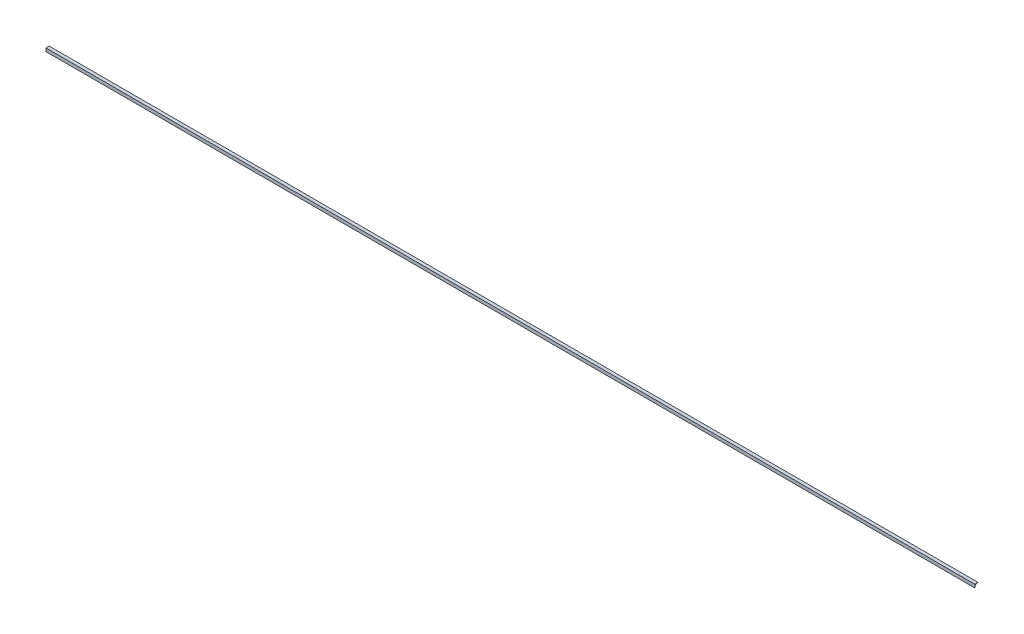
ISO-10303-21;
HEADER;
FILE_DESCRIPTION(('STEP AP214'),'2;1');
FILE_NAME('part.step','',(''),(''),'','','');
FILE_SCHEMA(('AUTOMOTIVE_DESIGN { 1 0 10303 214 1 1 1 1 }'));
ENDSEC;
DATA;
#1=APPLICATION_CONTEXT('core data for automotive mechanical design processes');
#2=APPLICATION_PROTOCOL_DEFINITION('international standard','automotive_design',2000,#1);
#3=PRODUCT_CONTEXT('',#1,'mechanical');
#4=PRODUCT('Part','Part','',(#3));
#5=PRODUCT_RELATED_PRODUCT_CATEGORY('part','',(#4));
#6=PRODUCT_DEFINITION_FORMATION('','',#4);
#7=PRODUCT_DEFINITION_CONTEXT('part definition',#1,'design');
#8=PRODUCT_DEFINITION('design','',#6,#7);
#9=PRODUCT_DEFINITION_SHAPE('','',#8);
#10=(LENGTH_UNIT() NAMED_UNIT(*) SI_UNIT(.MILLI.,.METRE.));
#11=(NAMED_UNIT(*) PLANE_ANGLE_UNIT() SI_UNIT($,.RADIAN.));
#12=(NAMED_UNIT(*) SI_UNIT($,.STERADIAN.) SOLID_ANGLE_UNIT());
#13=UNCERTAINTY_MEASURE_WITH_UNIT(LENGTH_MEASURE(1.E-05),#10,'distance_accuracy_value','');
#14=(GEOMETRIC_REPRESENTATION_CONTEXT(3) GLOBAL_UNCERTAINTY_ASSIGNED_CONTEXT((#13)) GLOBAL_UNIT_ASSIGNED_CONTEXT((#10,
#11,#12)) REPRESENTATION_CONTEXT('',''));
#15=CARTESIAN_POINT('',(0.,0.,0.));
#16=DIRECTION('',(0.,0.,1.));
#17=DIRECTION('',(1.,0.,0.));
#18=AXIS2_PLACEMENT_3D('',#15,#16,#17);
#19=CARTESIAN_POINT('',(457.2,76.2,74.6125));
#20=DIRECTION('',(0.,-1.,0.));
#21=DIRECTION('',(0.,0.,-1.));
#22=AXIS2_PLACEMENT_3D('',#19,#20,#21);
#23=PLANE('',#22);
#24=DIRECTION('',(0.,0.,1.));
#25=VECTOR('',#24,1.);
#26=CARTESIAN_POINT('',(0.,76.2,74.6125));
#27=LINE('',#26,#25);
#28=CARTESIAN_POINT('',(0.,76.2,74.6125));
#29=VERTEX_POINT('',#28);
#30=CARTESIAN_POINT('',(0.,76.2,76.2));
#31=VERTEX_POINT('',#30);
#32=EDGE_CURVE('E160',#29,#31,#27,.T.);
#33=ORIENTED_EDGE('',*,*,#32,.T.);
#34=DIRECTION('',(-1.,0.,0.));
#35=VECTOR('',#34,1.);
#36=CARTESIAN_POINT('',(457.2,76.2,76.2));
#37=LINE('',#36,#35);
#38=CARTESIAN_POINT('',(457.2,76.2,76.2));
#39=VERTEX_POINT('',#38);
#40=EDGE_CURVE('E11',#39,#31,#37,.T.);
#41=ORIENTED_EDGE('',*,*,#40,.F.);
#42=DIRECTION('',(0.,0.,1.));
#43=VECTOR('',#42,1.);
#44=CARTESIAN_POINT('',(457.2,76.2,74.6125));
#45=LINE('',#44,#43);
#46=CARTESIAN_POINT('',(457.2,76.2,74.6125));
#47=VERTEX_POINT('',#46);
#48=EDGE_CURVE('E184',#47,#39,#45,.T.);
#49=ORIENTED_EDGE('',*,*,#48,.F.);
#50=DIRECTION('',(-1.,0.,0.));
#51=VECTOR('',#50,1.);
#52=CARTESIAN_POINT('',(457.2,76.2,74.6125));
#53=LINE('',#52,#51);
#54=EDGE_CURVE('E151',#47,#29,#53,.T.);
#55=ORIENTED_EDGE('',*,*,#54,.T.);
#56=EDGE_LOOP('',(#33,#41,#49,#55));
#57=FACE_BOUND('',#56,.T.);
#58=ADVANCED_FACE('F43',(#57),#23,.F.);
#59=CARTESIAN_POINT('',(457.2,76.2,76.2));
#60=DIRECTION('',(0.,0.,-1.));
#61=DIRECTION('',(-1.,0.,0.));
#62=AXIS2_PLACEMENT_3D('',#59,#60,#61);
#63=PLANE('',#62);
#64=DIRECTION('',(0.,-1.,0.));
#65=VECTOR('',#64,1.);
#66=CARTESIAN_POINT('',(0.,76.2,76.2));
#67=LINE('',#66,#65);
#68=CARTESIAN_POINT('',(0.,74.6125,76.2));
#69=VERTEX_POINT('',#68);
#70=EDGE_CURVE('E162',#31,#69,#67,.T.);
#71=ORIENTED_EDGE('',*,*,#70,.T.);
#72=DIRECTION('',(-1.,0.,0.));
#73=VECTOR('',#72,1.);
#74=CARTESIAN_POINT('',(457.2,74.6125,76.2));
#75=LINE('',#74,#73);
#76=CARTESIAN_POINT('',(457.2,74.6125,76.2));
#77=VERTEX_POINT('',#76);
#78=EDGE_CURVE('E55',#77,#69,#75,.T.);
#79=ORIENTED_EDGE('',*,*,#78,.F.);
#80=DIRECTION('',(0.,-1.,0.));
#81=VECTOR('',#80,1.);
#82=CARTESIAN_POINT('',(457.2,76.2,76.2));
#83=LINE('',#82,#81);
#84=EDGE_CURVE('E107',#39,#77,#83,.T.);
#85=ORIENTED_EDGE('',*,*,#84,.F.);
#86=ORIENTED_EDGE('',*,*,#40,.T.);
#87=EDGE_LOOP('',(#71,#79,#85,#86));
#88=FACE_BOUND('',#87,.T.);
#89=ADVANCED_FACE('F283',(#88),#63,.F.);
#90=CARTESIAN_POINT('',(457.2,74.6125,76.2));
#91=DIRECTION('',(0.,0.0980171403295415,0.995184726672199));
#92=DIRECTION('',(0.,-0.995184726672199,0.0980171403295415));
#93=AXIS2_PLACEMENT_3D('',#90,#91,#92);
#94=PLANE('',#93);
#95=DIRECTION('',(0.,0.995184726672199,-0.0980171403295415));
#96=VECTOR('',#95,1.);
#97=CARTESIAN_POINT('',(0.,74.6125,76.2));
#98=LINE('',#97,#96);
#99=CARTESIAN_POINT('',(0.,74.9222058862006,76.1694966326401));
#100=VERTEX_POINT('',#99);
#101=EDGE_CURVE('E161',#69,#100,#98,.T.);
#102=ORIENTED_EDGE('',*,*,#101,.T.);
#103=DIRECTION('',(-1.,0.,0.));
#104=VECTOR('',#103,1.);
#105=CARTESIAN_POINT('',(457.2,74.9222058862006,76.1694966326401));
#106=LINE('',#105,#104);
#107=CARTESIAN_POINT('',(457.2,74.9222058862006,76.1694966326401));
#108=VERTEX_POINT('',#107);
#109=EDGE_CURVE('E204',#108,#100,#106,.T.);
#110=ORIENTED_EDGE('',*,*,#109,.F.);
#111=DIRECTION('',(0.,0.995184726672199,-0.0980171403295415));
#112=VECTOR('',#111,1.);
#113=CARTESIAN_POINT('',(457.2,74.6125,76.2));
#114=LINE('',#113,#112);
#115=EDGE_CURVE('E214',#77,#108,#114,.T.);
#116=ORIENTED_EDGE('',*,*,#115,.F.);
#117=ORIENTED_EDGE('',*,*,#78,.T.);
#118=EDGE_LOOP('',(#102,#110,#116,#117));
#119=FACE_BOUND('',#118,.T.);
#120=ADVANCED_FACE('F211',(#119),#94,.F.);
#121=CARTESIAN_POINT('',(457.2,74.9222058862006,76.1694966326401));
#122=DIRECTION('',(0.,0.290284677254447,0.956940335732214));
#123=DIRECTION('',(0.,-0.956940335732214,0.290284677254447));
#124=AXIS2_PLACEMENT_3D('',#121,#122,#123);
#125=PLANE('',#124);
#126=DIRECTION('',(0.,0.956940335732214,-0.290284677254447));
#127=VECTOR('',#126,1.);
#128=CARTESIAN_POINT('',(0.,74.9222058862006,76.1694966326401));
#129=LINE('',#128,#127);
#130=CARTESIAN_POINT('',(0.,75.2200099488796,76.0791587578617));
#131=VERTEX_POINT('',#130);
#132=EDGE_CURVE('E167',#100,#131,#129,.T.);
#133=ORIENTED_EDGE('',*,*,#132,.T.);
#134=DIRECTION('',(-1.,0.,0.));
#135=VECTOR('',#134,1.);
#136=CARTESIAN_POINT('',(457.2,75.2200099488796,76.0791587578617));
#137=LINE('',#136,#135);
#138=CARTESIAN_POINT('',(457.2,75.2200099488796,76.0791587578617));
#139=VERTEX_POINT('',#138);
#140=EDGE_CURVE('E199',#139,#131,#137,.T.);
#141=ORIENTED_EDGE('',*,*,#140,.F.);
#142=DIRECTION('',(0.,0.956940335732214,-0.290284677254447));
#143=VECTOR('',#142,1.);
#144=CARTESIAN_POINT('',(457.2,74.9222058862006,76.1694966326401));
#145=LINE('',#144,#143);
#146=EDGE_CURVE('E233',#108,#139,#145,.T.);
#147=ORIENTED_EDGE('',*,*,#146,.F.);
#148=ORIENTED_EDGE('',*,*,#109,.T.);
#149=EDGE_LOOP('',(#133,#141,#147,#148));
#150=FACE_BOUND('',#149,.T.);
#151=ADVANCED_FACE('F222',(#150),#125,.F.);
#152=CARTESIAN_POINT('',(457.2,75.2200099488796,76.0791587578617));
#153=DIRECTION('',(0.,0.47139673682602,0.881921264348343));
#154=DIRECTION('',(0.,-0.881921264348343,0.47139673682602));
#155=AXIS2_PLACEMENT_3D('',#152,#153,#154);
#156=PLANE('',#155);
#157=DIRECTION('',(0.,0.881921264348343,-0.47139673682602));
#158=VECTOR('',#157,1.);
#159=CARTESIAN_POINT('',(0.,75.2200099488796,76.0791587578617));
#160=LINE('',#159,#158);
#161=CARTESIAN_POINT('',(0.,75.4944677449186,75.9324580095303));
#162=VERTEX_POINT('',#161);
#163=EDGE_CURVE('E169',#131,#162,#160,.T.);
#164=ORIENTED_EDGE('',*,*,#163,.T.);
#165=DIRECTION('',(-1.,0.,0.));
#166=VECTOR('',#165,1.);
#167=CARTESIAN_POINT('',(457.2,75.4944677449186,75.9324580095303));
#168=LINE('',#167,#166);
#169=CARTESIAN_POINT('',(457.2,75.4944677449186,75.9324580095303));
#170=VERTEX_POINT('',#169);
#171=EDGE_CURVE('E198',#170,#162,#168,.T.);
#172=ORIENTED_EDGE('',*,*,#171,.F.);
#173=DIRECTION('',(0.,0.881921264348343,-0.47139673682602));
#174=VECTOR('',#173,1.);
#175=CARTESIAN_POINT('',(457.2,75.2200099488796,76.0791587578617));
#176=LINE('',#175,#174);
#177=EDGE_CURVE('E229',#139,#170,#176,.T.);
#178=ORIENTED_EDGE('',*,*,#177,.F.);
#179=ORIENTED_EDGE('',*,*,#140,.T.);
#180=EDGE_LOOP('',(#164,#172,#178,#179));
#181=FACE_BOUND('',#180,.T.);
#182=ADVANCED_FACE('F228',(#181),#156,.F.);
#183=CARTESIAN_POINT('',(457.2,75.4944677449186,75.9324580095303));
#184=DIRECTION('',(0.,0.634393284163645,0.773010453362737));
#185=DIRECTION('',(0.,-0.773010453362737,0.634393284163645));
#186=AXIS2_PLACEMENT_3D('',#183,#184,#185);
#187=PLANE('',#186);
#188=DIRECTION('',(0.,0.773010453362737,-0.634393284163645));
#189=VECTOR('',#188,1.);
#190=CARTESIAN_POINT('',(0.,75.4944677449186,75.9324580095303));
#191=LINE('',#190,#189);
#192=CARTESIAN_POINT('',(0.,75.7350320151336,75.7350320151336));
#193=VERTEX_POINT('',#192);
#194=EDGE_CURVE('E171',#162,#193,#191,.T.);
#195=ORIENTED_EDGE('',*,*,#194,.T.);
#196=DIRECTION('',(-1.,0.,0.));
#197=VECTOR('',#196,1.);
#198=CARTESIAN_POINT('',(457.2,75.7350320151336,75.7350320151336));
#199=LINE('',#198,#197);
#200=CARTESIAN_POINT('',(457.2,75.7350320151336,75.7350320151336));
#201=VERTEX_POINT('',#200);
#202=EDGE_CURVE('E195',#201,#193,#199,.T.);
#203=ORIENTED_EDGE('',*,*,#202,.F.);
#204=DIRECTION('',(0.,0.773010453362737,-0.634393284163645));
#205=VECTOR('',#204,1.);
#206=CARTESIAN_POINT('',(457.2,75.4944677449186,75.9324580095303));
#207=LINE('',#206,#205);
#208=EDGE_CURVE('E232',#170,#201,#207,.T.);
#209=ORIENTED_EDGE('',*,*,#208,.F.);
#210=ORIENTED_EDGE('',*,*,#171,.T.);
#211=EDGE_LOOP('',(#195,#203,#209,#210));
#212=FACE_BOUND('',#211,.T.);
#213=ADVANCED_FACE('F300',(#212),#187,.F.);
#214=CARTESIAN_POINT('',(457.2,75.7350320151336,75.7350320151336));
#215=DIRECTION('',(0.,0.773010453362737,0.634393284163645));
#216=DIRECTION('',(0.,-0.634393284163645,0.773010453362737));
#217=AXIS2_PLACEMENT_3D('',#214,#215,#216);
#218=PLANE('',#217);
#219=DIRECTION('',(0.,0.634393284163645,-0.773010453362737));
#220=VECTOR('',#219,1.);
#221=CARTESIAN_POINT('',(0.,75.7350320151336,75.7350320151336));
#222=LINE('',#221,#220);
#223=CARTESIAN_POINT('',(0.,75.9324580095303,75.4944677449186));
#224=VERTEX_POINT('',#223);
#225=EDGE_CURVE('E176',#193,#224,#222,.T.);
#226=ORIENTED_EDGE('',*,*,#225,.T.);
#227=DIRECTION('',(-1.,0.,0.));
#228=VECTOR('',#227,1.);
#229=CARTESIAN_POINT('',(457.2,75.9324580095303,75.4944677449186));
#230=LINE('',#229,#228);
#231=CARTESIAN_POINT('',(457.2,75.9324580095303,75.4944677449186));
#232=VERTEX_POINT('',#231);
#233=EDGE_CURVE('E144',#232,#224,#230,.T.);
#234=ORIENTED_EDGE('',*,*,#233,.F.);
#235=DIRECTION('',(0.,0.634393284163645,-0.773010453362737));
#236=VECTOR('',#235,1.);
#237=CARTESIAN_POINT('',(457.2,75.7350320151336,75.7350320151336));
#238=LINE('',#237,#236);
#239=EDGE_CURVE('E132',#201,#232,#238,.T.);
#240=ORIENTED_EDGE('',*,*,#239,.F.);
#241=ORIENTED_EDGE('',*,*,#202,.T.);
#242=EDGE_LOOP('',(#226,#234,#240,#241));
#243=FACE_BOUND('',#242,.T.);
#244=ADVANCED_FACE('F303',(#243),#218,.F.);
#245=CARTESIAN_POINT('',(457.2,75.9324580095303,75.4944677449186));
#246=DIRECTION('',(0.,0.881921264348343,0.47139673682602));
#247=DIRECTION('',(0.,-0.47139673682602,0.881921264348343));
#248=AXIS2_PLACEMENT_3D('',#245,#246,#247);
#249=PLANE('',#248);
#250=DIRECTION('',(0.,0.47139673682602,-0.881921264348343));
#251=VECTOR('',#250,1.);
#252=CARTESIAN_POINT('',(0.,75.9324580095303,75.4944677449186));
#253=LINE('',#252,#251);
#254=CARTESIAN_POINT('',(0.,76.0791587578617,75.2200099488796));
#255=VERTEX_POINT('',#254);
#256=EDGE_CURVE('E142',#224,#255,#253,.T.);
#257=ORIENTED_EDGE('',*,*,#256,.T.);
#258=DIRECTION('',(-1.,0.,0.));
#259=VECTOR('',#258,1.);
#260=CARTESIAN_POINT('',(457.2,76.0791587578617,75.2200099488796));
#261=LINE('',#260,#259);
#262=CARTESIAN_POINT('',(457.2,76.0791587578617,75.2200099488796));
#263=VERTEX_POINT('',#262);
#264=EDGE_CURVE('E139',#263,#255,#261,.T.);
#265=ORIENTED_EDGE('',*,*,#264,.F.);
#266=DIRECTION('',(0.,0.47139673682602,-0.881921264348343));
#267=VECTOR('',#266,1.);
#268=CARTESIAN_POINT('',(457.2,75.9324580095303,75.4944677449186));
#269=LINE('',#268,#267);
#270=EDGE_CURVE('E126',#232,#263,#269,.T.);
#271=ORIENTED_EDGE('',*,*,#270,.F.);
#272=ORIENTED_EDGE('',*,*,#233,.T.);
#273=EDGE_LOOP('',(#257,#265,#271,#272));
#274=FACE_BOUND('',#273,.T.);
#275=ADVANCED_FACE('F141',(#274),#249,.F.);
#276=CARTESIAN_POINT('',(457.2,76.0791587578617,75.2200099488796));
#277=DIRECTION('',(0.,0.956940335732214,0.290284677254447));
#278=DIRECTION('',(0.,-0.290284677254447,0.956940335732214));
#279=AXIS2_PLACEMENT_3D('',#276,#277,#278);
#280=PLANE('',#279);
#281=DIRECTION('',(0.,0.290284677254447,-0.956940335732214));
#282=VECTOR('',#281,1.);
#283=CARTESIAN_POINT('',(0.,76.0791587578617,75.2200099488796));
#284=LINE('',#283,#282);
#285=CARTESIAN_POINT('',(0.,76.1694966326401,74.9222058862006));
#286=VERTEX_POINT('',#285);
#287=EDGE_CURVE('E94',#255,#286,#284,.T.);
#288=ORIENTED_EDGE('',*,*,#287,.T.);
#289=DIRECTION('',(-1.,0.,0.));
#290=VECTOR('',#289,1.);
#291=CARTESIAN_POINT('',(457.2,76.1694966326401,74.9222058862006));
#292=LINE('',#291,#290);
#293=CARTESIAN_POINT('',(457.2,76.1694966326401,74.9222058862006));
#294=VERTEX_POINT('',#293);
#295=EDGE_CURVE('E147',#294,#286,#292,.T.);
#296=ORIENTED_EDGE('',*,*,#295,.F.);
#297=DIRECTION('',(0.,0.290284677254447,-0.956940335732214));
#298=VECTOR('',#297,1.);
#299=CARTESIAN_POINT('',(457.2,76.0791587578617,75.2200099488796));
#300=LINE('',#299,#298);
#301=EDGE_CURVE('E135',#263,#294,#300,.T.);
#302=ORIENTED_EDGE('',*,*,#301,.F.);
#303=ORIENTED_EDGE('',*,*,#264,.T.);
#304=EDGE_LOOP('',(#288,#296,#302,#303));
#305=FACE_BOUND('',#304,.T.);
#306=ADVANCED_FACE('F149',(#305),#280,.F.);
#307=CARTESIAN_POINT('',(457.2,76.1694966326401,74.9222058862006));
#308=DIRECTION('',(0.,0.995184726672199,0.0980171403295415));
#309=DIRECTION('',(0.,-0.0980171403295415,0.995184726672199));
#310=AXIS2_PLACEMENT_3D('',#307,#308,#309);
#311=PLANE('',#310);
#312=DIRECTION('',(0.,0.0980171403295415,-0.995184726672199));
#313=VECTOR('',#312,1.);
#314=CARTESIAN_POINT('',(0.,76.1694966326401,74.9222058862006));
#315=LINE('',#314,#313);
#316=EDGE_CURVE('E102',#286,#29,#315,.T.);
#317=ORIENTED_EDGE('',*,*,#316,.T.);
#318=ORIENTED_EDGE('',*,*,#54,.F.);
#319=DIRECTION('',(0.,0.0980171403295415,-0.995184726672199));
#320=VECTOR('',#319,1.);
#321=CARTESIAN_POINT('',(457.2,76.1694966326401,74.9222058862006));
#322=LINE('',#321,#320);
#323=EDGE_CURVE('E58',#294,#47,#322,.T.);
#324=ORIENTED_EDGE('',*,*,#323,.F.);
#325=ORIENTED_EDGE('',*,*,#295,.T.);
#326=EDGE_LOOP('',(#317,#318,#324,#325));
#327=FACE_BOUND('',#326,.T.);
#328=ADVANCED_FACE('F307',(#327),#311,.F.);
#329=CARTESIAN_POINT('',(457.2,0.,0.));
#330=DIRECTION('',(1.,0.,0.));
#331=DIRECTION('',(0.,0.,-1.));
#332=AXIS2_PLACEMENT_3D('',#329,#330,#331);
#333=PLANE('',#332);
#334=ORIENTED_EDGE('',*,*,#48,.T.);
#335=ORIENTED_EDGE('',*,*,#84,.T.);
#336=ORIENTED_EDGE('',*,*,#115,.T.);
#337=ORIENTED_EDGE('',*,*,#146,.T.);
#338=ORIENTED_EDGE('',*,*,#177,.T.);
#339=ORIENTED_EDGE('',*,*,#208,.T.);
#340=ORIENTED_EDGE('',*,*,#239,.T.);
#341=ORIENTED_EDGE('',*,*,#270,.T.);
#342=ORIENTED_EDGE('',*,*,#301,.T.);
#343=ORIENTED_EDGE('',*,*,#323,.T.);
#344=EDGE_LOOP('',(#334,#335,#336,#337,#338,#339,#340,#341,#342,#343));
#345=FACE_BOUND('',#344,.T.);
#346=ADVANCED_FACE('F127',(#345),#333,.T.);
#347=CARTESIAN_POINT('',(0.,0.,0.));
#348=DIRECTION('',(1.,0.,0.));
#349=DIRECTION('',(0.,0.,-1.));
#350=AXIS2_PLACEMENT_3D('',#347,#348,#349);
#351=PLANE('',#350);
#352=ORIENTED_EDGE('',*,*,#32,.F.);
#353=ORIENTED_EDGE('',*,*,#316,.F.);
#354=ORIENTED_EDGE('',*,*,#287,.F.);
#355=ORIENTED_EDGE('',*,*,#256,.F.);
#356=ORIENTED_EDGE('',*,*,#225,.F.);
#357=ORIENTED_EDGE('',*,*,#194,.F.);
#358=ORIENTED_EDGE('',*,*,#163,.F.);
#359=ORIENTED_EDGE('',*,*,#132,.F.);
#360=ORIENTED_EDGE('',*,*,#101,.F.);
#361=ORIENTED_EDGE('',*,*,#70,.F.);
#362=EDGE_LOOP('',(#352,#353,#354,#355,#356,#357,#358,#359,#360,#361));
#363=FACE_BOUND('',#362,.T.);
#364=ADVANCED_FACE('F219',(#363),#351,.F.);
#365=CLOSED_SHELL('',(#58,#89,#120,#151,#182,#213,#244,#275,#306,#328,#346,#364));
#366=MANIFOLD_SOLID_BREP('B2',#365);
#367=ADVANCED_BREP_SHAPE_REPRESENTATION('',(#18,#366),#14);
#368=SHAPE_DEFINITION_REPRESENTATION(#9,#367);
ENDSEC;
END-ISO-10303-21;
